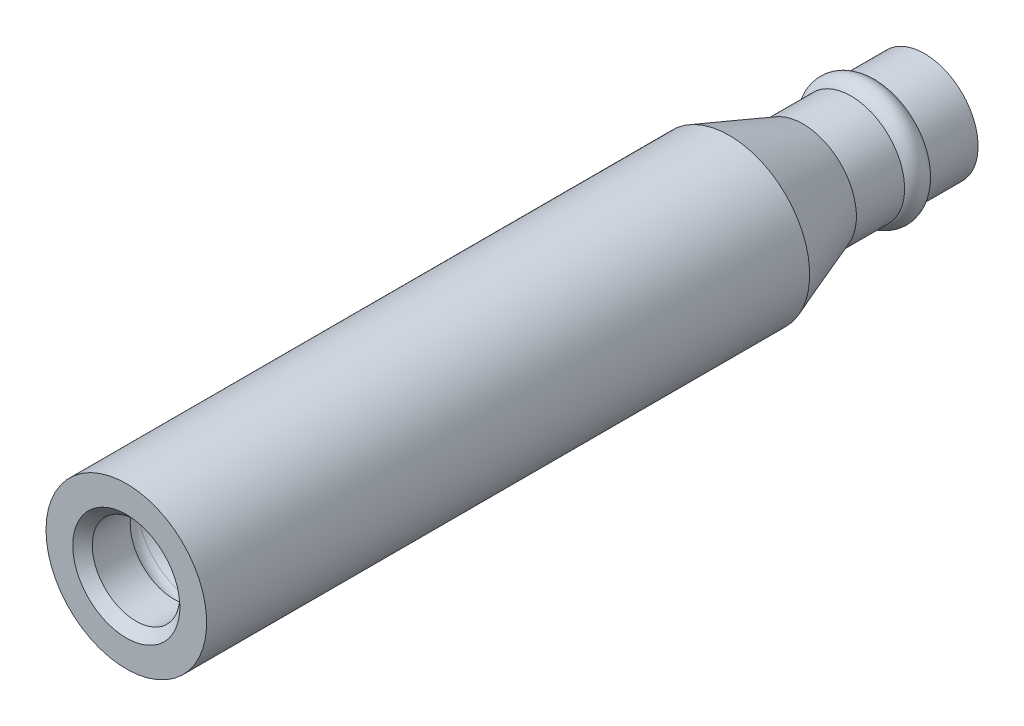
ISO-10303-21;
HEADER;
FILE_DESCRIPTION(('STEP AP214'),'2;1');
FILE_NAME('part.step','',(''),(''),'','','');
FILE_SCHEMA(('AUTOMOTIVE_DESIGN { 1 0 10303 214 1 1 1 1 }'));
ENDSEC;
DATA;
#1=APPLICATION_CONTEXT('core data for automotive mechanical design processes');
#2=APPLICATION_PROTOCOL_DEFINITION('international standard','automotive_design',2000,#1);
#3=PRODUCT_CONTEXT('',#1,'mechanical');
#4=PRODUCT('Part','Part','',(#3));
#5=PRODUCT_RELATED_PRODUCT_CATEGORY('part','',(#4));
#6=PRODUCT_DEFINITION_FORMATION('','',#4);
#7=PRODUCT_DEFINITION_CONTEXT('part definition',#1,'design');
#8=PRODUCT_DEFINITION('design','',#6,#7);
#9=PRODUCT_DEFINITION_SHAPE('','',#8);
#10=(LENGTH_UNIT() NAMED_UNIT(*) SI_UNIT(.MILLI.,.METRE.));
#11=(NAMED_UNIT(*) PLANE_ANGLE_UNIT() SI_UNIT($,.RADIAN.));
#12=(NAMED_UNIT(*) SI_UNIT($,.STERADIAN.) SOLID_ANGLE_UNIT());
#13=UNCERTAINTY_MEASURE_WITH_UNIT(LENGTH_MEASURE(1.E-05),#10,'distance_accuracy_value','');
#14=(GEOMETRIC_REPRESENTATION_CONTEXT(3) GLOBAL_UNCERTAINTY_ASSIGNED_CONTEXT((#13)) GLOBAL_UNIT_ASSIGNED_CONTEXT((#10,
#11,#12)) REPRESENTATION_CONTEXT('',''));
#15=CARTESIAN_POINT('',(0.,0.,0.));
#16=DIRECTION('',(0.,0.,1.));
#17=DIRECTION('',(1.,0.,0.));
#18=AXIS2_PLACEMENT_3D('',#15,#16,#17);
#19=CARTESIAN_POINT('',(0.,0.,-16.129));
#20=DIRECTION('',(0.,0.,-1.));
#21=DIRECTION('',(-1.,0.,0.));
#22=AXIS2_PLACEMENT_3D('',#19,#20,#21);
#23=CYLINDRICAL_SURFACE('',#22,4.191);
#24=CARTESIAN_POINT('',(0.,0.,20.828));
#25=DIRECTION('',(0.,0.,-1.));
#26=DIRECTION('',(-1.,0.,0.));
#27=AXIS2_PLACEMENT_3D('',#24,#25,#26);
#28=CIRCLE('',#27,4.191);
#29=CARTESIAN_POINT('',(-4.191,0.,20.828));
#30=VERTEX_POINT('',#29);
#31=EDGE_CURVE('E10',#30,#30,#28,.T.);
#32=ORIENTED_EDGE('',*,*,#31,.T.);
#33=EDGE_LOOP('',(#32));
#34=FACE_BOUND('',#33,.T.);
#35=CARTESIAN_POINT('',(0.,0.,-10.6397740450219));
#36=DIRECTION('',(0.,0.,-1.));
#37=DIRECTION('',(-1.,0.,0.));
#38=AXIS2_PLACEMENT_3D('',#35,#36,#37);
#39=CIRCLE('',#38,4.191);
#40=CARTESIAN_POINT('',(-4.191,0.,-10.6397740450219));
#41=VERTEX_POINT('',#40);
#42=EDGE_CURVE('E87',#41,#41,#39,.T.);
#43=ORIENTED_EDGE('',*,*,#42,.F.);
#44=EDGE_LOOP('',(#43));
#45=FACE_BOUND('',#44,.T.);
#46=ADVANCED_FACE('F29',(#34,#45),#23,.T.);
#47=CARTESIAN_POINT('',(0.,2.794,20.828));
#48=DIRECTION('',(0.,0.,1.));
#49=DIRECTION('',(1.,0.,0.));
#50=AXIS2_PLACEMENT_3D('',#47,#48,#49);
#51=PLANE('',#50);
#52=CARTESIAN_POINT('',(0.,0.,20.828));
#53=DIRECTION('',(0.,0.,-1.));
#54=DIRECTION('',(-1.,0.,0.));
#55=AXIS2_PLACEMENT_3D('',#52,#53,#54);
#56=CIRCLE('',#55,2.794);
#57=CARTESIAN_POINT('',(-2.794,0.,20.828));
#58=VERTEX_POINT('',#57);
#59=EDGE_CURVE('E35',#58,#58,#56,.T.);
#60=ORIENTED_EDGE('',*,*,#59,.T.);
#61=EDGE_LOOP('',(#60));
#62=FACE_BOUND('',#61,.T.);
#63=ORIENTED_EDGE('',*,*,#31,.F.);
#64=EDGE_LOOP('',(#63));
#65=FACE_BOUND('',#64,.T.);
#66=ADVANCED_FACE('F95',(#62,#65),#51,.T.);
#67=CARTESIAN_POINT('',(0.,0.,20.828));
#68=DIRECTION('',(0.,0.,1.));
#69=DIRECTION('',(1.,0.,0.));
#70=AXIS2_PLACEMENT_3D('',#67,#68,#69);
#71=CONICAL_SURFACE('',#70,2.794,0.785398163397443);
#72=CARTESIAN_POINT('',(0.,0.,20.32));
#73=DIRECTION('',(0.,0.,-1.));
#74=DIRECTION('',(-1.,0.,0.));
#75=AXIS2_PLACEMENT_3D('',#72,#73,#74);
#76=CIRCLE('',#75,2.286);
#77=CARTESIAN_POINT('',(-2.286,0.,20.32));
#78=VERTEX_POINT('',#77);
#79=EDGE_CURVE('E39',#78,#78,#76,.T.);
#80=ORIENTED_EDGE('',*,*,#79,.T.);
#81=EDGE_LOOP('',(#80));
#82=FACE_BOUND('',#81,.T.);
#83=ORIENTED_EDGE('',*,*,#59,.F.);
#84=EDGE_LOOP('',(#83));
#85=FACE_BOUND('',#84,.T.);
#86=ADVANCED_FACE('F99',(#82,#85),#71,.F.);
#87=CARTESIAN_POINT('',(0.,0.,-16.129));
#88=DIRECTION('',(0.,0.,-1.));
#89=DIRECTION('',(-1.,0.,0.));
#90=AXIS2_PLACEMENT_3D('',#87,#88,#89);
#91=CYLINDRICAL_SURFACE('',#90,2.286);
#92=CARTESIAN_POINT('',(0.,0.,18.3388));
#93=DIRECTION('',(0.,0.,-1.));
#94=DIRECTION('',(-1.,0.,0.));
#95=AXIS2_PLACEMENT_3D('',#92,#93,#94);
#96=CIRCLE('',#95,2.286);
#97=CARTESIAN_POINT('',(-2.286,0.,18.3388));
#98=VERTEX_POINT('',#97);
#99=EDGE_CURVE('E43',#98,#98,#96,.T.);
#100=ORIENTED_EDGE('',*,*,#99,.T.);
#101=EDGE_LOOP('',(#100));
#102=FACE_BOUND('',#101,.T.);
#103=ORIENTED_EDGE('',*,*,#79,.F.);
#104=EDGE_LOOP('',(#103));
#105=FACE_BOUND('',#104,.T.);
#106=ADVANCED_FACE('F103',(#102,#105),#91,.F.);
#107=CARTESIAN_POINT('',(0.,0.,17.5768));
#108=DIRECTION('',(0.,0.,-1.));
#109=DIRECTION('',(-1.,0.,0.));
#110=AXIS2_PLACEMENT_3D('',#107,#108,#109);
#111=TOROIDAL_SURFACE('',#110,2.286,0.762);
#112=CARTESIAN_POINT('',(0.,0.,17.2547648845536));
#113=DIRECTION('',(0.,0.,-1.));
#114=DIRECTION('',(-1.,0.,0.));
#115=AXIS2_PLACEMENT_3D('',#112,#113,#114);
#116=CIRCLE('',#115,2.97660653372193);
#117=CARTESIAN_POINT('',(-2.97660653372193,0.,17.2547648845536));
#118=VERTEX_POINT('',#117);
#119=EDGE_CURVE('E48',#118,#118,#116,.T.);
#120=ORIENTED_EDGE('',*,*,#119,.T.);
#121=EDGE_LOOP('',(#120));
#122=FACE_BOUND('',#121,.T.);
#123=ORIENTED_EDGE('',*,*,#99,.F.);
#124=EDGE_LOOP('',(#123));
#125=FACE_BOUND('',#124,.T.);
#126=ADVANCED_FACE('F110',(#122,#125),#111,.F.);
#127=CARTESIAN_POINT('',(0.,0.,17.2547648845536));
#128=DIRECTION('',(0.,0.,1.));
#129=DIRECTION('',(1.,0.,0.));
#130=AXIS2_PLACEMENT_3D('',#127,#128,#129);
#131=CONICAL_SURFACE('',#130,2.97660653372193,0.436332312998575);
#132=CARTESIAN_POINT('',(0.,0.,15.7737543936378));
#133=DIRECTION('',(0.,0.,-1.));
#134=DIRECTION('',(-1.,0.,0.));
#135=AXIS2_PLACEMENT_3D('',#132,#133,#134);
#136=CIRCLE('',#135,2.286);
#137=CARTESIAN_POINT('',(-2.286,0.,15.7737543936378));
#138=VERTEX_POINT('',#137);
#139=EDGE_CURVE('E51',#138,#138,#136,.T.);
#140=ORIENTED_EDGE('',*,*,#139,.T.);
#141=EDGE_LOOP('',(#140));
#142=FACE_BOUND('',#141,.T.);
#143=ORIENTED_EDGE('',*,*,#119,.F.);
#144=EDGE_LOOP('',(#143));
#145=FACE_BOUND('',#144,.T.);
#146=ADVANCED_FACE('F114',(#142,#145),#131,.F.);
#147=CARTESIAN_POINT('',(0.,0.,-16.129));
#148=DIRECTION('',(0.,0.,-1.));
#149=DIRECTION('',(-1.,0.,0.));
#150=AXIS2_PLACEMENT_3D('',#147,#148,#149);
#151=CYLINDRICAL_SURFACE('',#150,2.286);
#152=CARTESIAN_POINT('',(0.,0.,12.446));
#153=DIRECTION('',(0.,0.,-1.));
#154=DIRECTION('',(-1.,0.,0.));
#155=AXIS2_PLACEMENT_3D('',#152,#153,#154);
#156=CIRCLE('',#155,2.286);
#157=CARTESIAN_POINT('',(-2.286,0.,12.446));
#158=VERTEX_POINT('',#157);
#159=EDGE_CURVE('E54',#158,#158,#156,.T.);
#160=ORIENTED_EDGE('',*,*,#159,.T.);
#161=EDGE_LOOP('',(#160));
#162=FACE_BOUND('',#161,.T.);
#163=ORIENTED_EDGE('',*,*,#139,.F.);
#164=EDGE_LOOP('',(#163));
#165=FACE_BOUND('',#164,.T.);
#166=ADVANCED_FACE('F118',(#162,#165),#151,.F.);
#167=CARTESIAN_POINT('',(0.,2.6924,12.446));
#168=DIRECTION('',(0.,0.,-1.));
#169=DIRECTION('',(-1.,0.,0.));
#170=AXIS2_PLACEMENT_3D('',#167,#168,#169);
#171=PLANE('',#170);
#172=CARTESIAN_POINT('',(0.,0.,12.446));
#173=DIRECTION('',(0.,0.,-1.));
#174=DIRECTION('',(-1.,0.,0.));
#175=AXIS2_PLACEMENT_3D('',#172,#173,#174);
#176=CIRCLE('',#175,2.6924);
#177=CARTESIAN_POINT('',(-2.6924,0.,12.446));
#178=VERTEX_POINT('',#177);
#179=EDGE_CURVE('E57',#178,#178,#176,.T.);
#180=ORIENTED_EDGE('',*,*,#179,.T.);
#181=EDGE_LOOP('',(#180));
#182=FACE_BOUND('',#181,.T.);
#183=ORIENTED_EDGE('',*,*,#159,.F.);
#184=EDGE_LOOP('',(#183));
#185=FACE_BOUND('',#184,.T.);
#186=ADVANCED_FACE('F122',(#182,#185),#171,.T.);
#187=CARTESIAN_POINT('',(0.,0.,-16.129));
#188=DIRECTION('',(0.,0.,-1.));
#189=DIRECTION('',(-1.,0.,0.));
#190=AXIS2_PLACEMENT_3D('',#187,#188,#189);
#191=CYLINDRICAL_SURFACE('',#190,2.6924);
#192=CARTESIAN_POINT('',(0.,0.,-2.032));
#193=DIRECTION('',(0.,0.,-1.));
#194=DIRECTION('',(-1.,0.,0.));
#195=AXIS2_PLACEMENT_3D('',#192,#193,#194);
#196=CIRCLE('',#195,2.6924);
#197=CARTESIAN_POINT('',(-2.6924,0.,-2.032));
#198=VERTEX_POINT('',#197);
#199=EDGE_CURVE('E60',#198,#198,#196,.T.);
#200=ORIENTED_EDGE('',*,*,#199,.T.);
#201=EDGE_LOOP('',(#200));
#202=FACE_BOUND('',#201,.T.);
#203=ORIENTED_EDGE('',*,*,#179,.F.);
#204=EDGE_LOOP('',(#203));
#205=FACE_BOUND('',#204,.T.);
#206=ADVANCED_FACE('F126',(#202,#205),#191,.F.);
#207=CARTESIAN_POINT('',(0.,1.7526,-2.032));
#208=DIRECTION('',(0.,0.,1.));
#209=DIRECTION('',(1.,0.,0.));
#210=AXIS2_PLACEMENT_3D('',#207,#208,#209);
#211=PLANE('',#210);
#212=CARTESIAN_POINT('',(0.,0.,-2.032));
#213=DIRECTION('',(0.,0.,-1.));
#214=DIRECTION('',(-1.,0.,0.));
#215=AXIS2_PLACEMENT_3D('',#212,#213,#214);
#216=CIRCLE('',#215,1.7526);
#217=CARTESIAN_POINT('',(-1.7526,0.,-2.032));
#218=VERTEX_POINT('',#217);
#219=EDGE_CURVE('E63',#218,#218,#216,.T.);
#220=ORIENTED_EDGE('',*,*,#219,.T.);
#221=EDGE_LOOP('',(#220));
#222=FACE_BOUND('',#221,.T.);
#223=ORIENTED_EDGE('',*,*,#199,.F.);
#224=EDGE_LOOP('',(#223));
#225=FACE_BOUND('',#224,.T.);
#226=ADVANCED_FACE('F130',(#222,#225),#211,.T.);
#227=CARTESIAN_POINT('',(0.,0.,-16.129));
#228=DIRECTION('',(0.,0.,-1.));
#229=DIRECTION('',(-1.,0.,0.));
#230=AXIS2_PLACEMENT_3D('',#227,#228,#229);
#231=CYLINDRICAL_SURFACE('',#230,1.7526);
#232=CARTESIAN_POINT('',(0.,0.,-8.128));
#233=DIRECTION('',(0.,0.,-1.));
#234=DIRECTION('',(-1.,0.,0.));
#235=AXIS2_PLACEMENT_3D('',#232,#233,#234);
#236=CIRCLE('',#235,1.75260000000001);
#237=CARTESIAN_POINT('',(-1.75260000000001,0.,-8.128));
#238=VERTEX_POINT('',#237);
#239=EDGE_CURVE('E66',#238,#238,#236,.T.);
#240=ORIENTED_EDGE('',*,*,#239,.T.);
#241=EDGE_LOOP('',(#240));
#242=FACE_BOUND('',#241,.T.);
#243=ORIENTED_EDGE('',*,*,#219,.F.);
#244=EDGE_LOOP('',(#243));
#245=FACE_BOUND('',#244,.T.);
#246=ADVANCED_FACE('F134',(#242,#245),#231,.F.);
#247=CARTESIAN_POINT('',(0.,0.634999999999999,-8.128));
#248=DIRECTION('',(0.,0.,1.));
#249=DIRECTION('',(1.,0.,0.));
#250=AXIS2_PLACEMENT_3D('',#247,#248,#249);
#251=PLANE('',#250);
#252=CARTESIAN_POINT('',(0.,0.,-8.128));
#253=DIRECTION('',(0.,0.,-1.));
#254=DIRECTION('',(-1.,0.,0.));
#255=AXIS2_PLACEMENT_3D('',#252,#253,#254);
#256=CIRCLE('',#255,0.635000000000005);
#257=CARTESIAN_POINT('',(-0.635000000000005,0.,-8.128));
#258=VERTEX_POINT('',#257);
#259=EDGE_CURVE('E69',#258,#258,#256,.T.);
#260=ORIENTED_EDGE('',*,*,#259,.T.);
#261=EDGE_LOOP('',(#260));
#262=FACE_BOUND('',#261,.T.);
#263=ORIENTED_EDGE('',*,*,#239,.F.);
#264=EDGE_LOOP('',(#263));
#265=FACE_BOUND('',#264,.T.);
#266=ADVANCED_FACE('F138',(#262,#265),#251,.T.);
#267=CARTESIAN_POINT('',(0.,0.,-16.129));
#268=DIRECTION('',(0.,0.,-1.));
#269=DIRECTION('',(-1.,0.,0.));
#270=AXIS2_PLACEMENT_3D('',#267,#268,#269);
#271=CYLINDRICAL_SURFACE('',#270,0.635000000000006);
#272=CARTESIAN_POINT('',(0.,0.,-20.828));
#273=DIRECTION('',(0.,0.,-1.));
#274=DIRECTION('',(-1.,0.,0.));
#275=AXIS2_PLACEMENT_3D('',#272,#273,#274);
#276=CIRCLE('',#275,0.635000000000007);
#277=CARTESIAN_POINT('',(-0.635000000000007,0.,-20.828));
#278=VERTEX_POINT('',#277);
#279=EDGE_CURVE('E72',#278,#278,#276,.T.);
#280=ORIENTED_EDGE('',*,*,#279,.T.);
#281=EDGE_LOOP('',(#280));
#282=FACE_BOUND('',#281,.T.);
#283=ORIENTED_EDGE('',*,*,#259,.F.);
#284=EDGE_LOOP('',(#283));
#285=FACE_BOUND('',#284,.T.);
#286=ADVANCED_FACE('F142',(#282,#285),#271,.F.);
#287=CARTESIAN_POINT('',(0.,2.794,-20.828));
#288=DIRECTION('',(0.,0.,-1.));
#289=DIRECTION('',(-1.,0.,0.));
#290=AXIS2_PLACEMENT_3D('',#287,#288,#289);
#291=PLANE('',#290);
#292=CARTESIAN_POINT('',(0.,0.,-20.828));
#293=DIRECTION('',(0.,0.,-1.));
#294=DIRECTION('',(-1.,0.,0.));
#295=AXIS2_PLACEMENT_3D('',#292,#293,#294);
#296=CIRCLE('',#295,2.79400000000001);
#297=CARTESIAN_POINT('',(-2.79400000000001,0.,-20.828));
#298=VERTEX_POINT('',#297);
#299=EDGE_CURVE('E75',#298,#298,#296,.T.);
#300=ORIENTED_EDGE('',*,*,#299,.T.);
#301=EDGE_LOOP('',(#300));
#302=FACE_BOUND('',#301,.T.);
#303=ORIENTED_EDGE('',*,*,#279,.F.);
#304=EDGE_LOOP('',(#303));
#305=FACE_BOUND('',#304,.T.);
#306=ADVANCED_FACE('F146',(#302,#305),#291,.T.);
#307=CARTESIAN_POINT('',(0.,0.,-16.129));
#308=DIRECTION('',(0.,0.,-1.));
#309=DIRECTION('',(-1.,0.,0.));
#310=AXIS2_PLACEMENT_3D('',#307,#308,#309);
#311=CYLINDRICAL_SURFACE('',#310,2.79400000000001);
#312=CARTESIAN_POINT('',(0.,0.,-18.3129113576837));
#313=DIRECTION('',(0.,0.,-1.));
#314=DIRECTION('',(-1.,0.,0.));
#315=AXIS2_PLACEMENT_3D('',#312,#313,#314);
#316=CIRCLE('',#315,2.79400000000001);
#317=CARTESIAN_POINT('',(-2.79400000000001,0.,-18.3129113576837));
#318=VERTEX_POINT('',#317);
#319=EDGE_CURVE('E78',#318,#318,#316,.T.);
#320=ORIENTED_EDGE('',*,*,#319,.T.);
#321=EDGE_LOOP('',(#320));
#322=FACE_BOUND('',#321,.T.);
#323=ORIENTED_EDGE('',*,*,#299,.F.);
#324=EDGE_LOOP('',(#323));
#325=FACE_BOUND('',#324,.T.);
#326=ADVANCED_FACE('F150',(#322,#325),#311,.T.);
#327=CARTESIAN_POINT('',(0.,0.,-17.653));
#328=DIRECTION('',(0.,0.,-1.));
#329=DIRECTION('',(-1.,0.,0.));
#330=AXIS2_PLACEMENT_3D('',#327,#328,#329);
#331=TOROIDAL_SURFACE('',#330,2.41300000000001,0.762000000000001);
#332=CARTESIAN_POINT('',(0.,0.,-16.9930886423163));
#333=DIRECTION('',(0.,0.,-1.));
#334=DIRECTION('',(-1.,0.,0.));
#335=AXIS2_PLACEMENT_3D('',#332,#333,#334);
#336=CIRCLE('',#335,2.79400000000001);
#337=CARTESIAN_POINT('',(-2.79400000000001,0.,-16.9930886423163));
#338=VERTEX_POINT('',#337);
#339=EDGE_CURVE('E81',#338,#338,#336,.T.);
#340=ORIENTED_EDGE('',*,*,#339,.T.);
#341=EDGE_LOOP('',(#340));
#342=FACE_BOUND('',#341,.T.);
#343=ORIENTED_EDGE('',*,*,#319,.F.);
#344=EDGE_LOOP('',(#343));
#345=FACE_BOUND('',#344,.T.);
#346=ADVANCED_FACE('F154',(#342,#345),#331,.T.);
#347=CARTESIAN_POINT('',(0.,0.,-16.129));
#348=DIRECTION('',(0.,0.,-1.));
#349=DIRECTION('',(-1.,0.,0.));
#350=AXIS2_PLACEMENT_3D('',#347,#348,#349);
#351=CYLINDRICAL_SURFACE('',#350,2.79400000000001);
#352=CARTESIAN_POINT('',(0.,0.,-14.478));
#353=DIRECTION('',(0.,0.,-1.));
#354=DIRECTION('',(-1.,0.,0.));
#355=AXIS2_PLACEMENT_3D('',#352,#353,#354);
#356=CIRCLE('',#355,2.79400000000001);
#357=CARTESIAN_POINT('',(-2.79400000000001,0.,-14.478));
#358=VERTEX_POINT('',#357);
#359=EDGE_CURVE('E84',#358,#358,#356,.T.);
#360=ORIENTED_EDGE('',*,*,#359,.T.);
#361=EDGE_LOOP('',(#360));
#362=FACE_BOUND('',#361,.T.);
#363=ORIENTED_EDGE('',*,*,#339,.F.);
#364=EDGE_LOOP('',(#363));
#365=FACE_BOUND('',#364,.T.);
#366=ADVANCED_FACE('F158',(#362,#365),#351,.T.);
#367=CARTESIAN_POINT('',(0.,0.,-14.478));
#368=DIRECTION('',(0.,0.,1.));
#369=DIRECTION('',(1.,0.,0.));
#370=AXIS2_PLACEMENT_3D('',#367,#368,#369);
#371=CONICAL_SURFACE('',#370,2.79400000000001,0.349065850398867);
#372=ORIENTED_EDGE('',*,*,#42,.T.);
#373=EDGE_LOOP('',(#372));
#374=FACE_BOUND('',#373,.T.);
#375=ORIENTED_EDGE('',*,*,#359,.F.);
#376=EDGE_LOOP('',(#375));
#377=FACE_BOUND('',#376,.T.);
#378=ADVANCED_FACE('F91',(#374,#377),#371,.T.);
#379=CLOSED_SHELL('',(#46,#66,#86,#106,#126,#146,#166,#186,#206,#226,#246,#266,#286,#306,#326,
#346,#366,#378));
#380=MANIFOLD_SOLID_BREP('B2',#379);
#381=ADVANCED_BREP_SHAPE_REPRESENTATION('',(#18,#380),#14);
#382=SHAPE_DEFINITION_REPRESENTATION(#9,#381);
ENDSEC;
END-ISO-10303-21;
